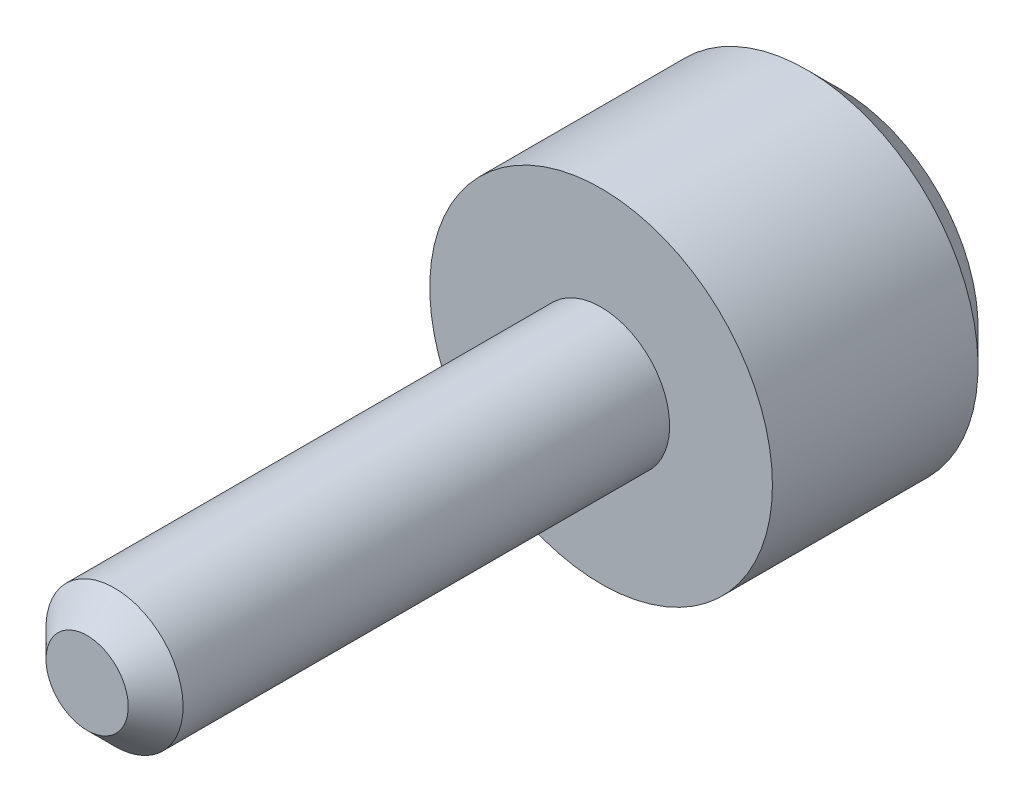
ISO-10303-21;
HEADER;
FILE_DESCRIPTION(('STEP AP214'),'2;1');
FILE_NAME('part.step','',(''),(''),'','','');
FILE_SCHEMA(('AUTOMOTIVE_DESIGN { 1 0 10303 214 1 1 1 1 }'));
ENDSEC;
DATA;
#1=APPLICATION_CONTEXT('core data for automotive mechanical design processes');
#2=APPLICATION_PROTOCOL_DEFINITION('international standard','automotive_design',2000,#1);
#3=PRODUCT_CONTEXT('',#1,'mechanical');
#4=PRODUCT('Part','Part','',(#3));
#5=PRODUCT_RELATED_PRODUCT_CATEGORY('part','',(#4));
#6=PRODUCT_DEFINITION_FORMATION('','',#4);
#7=PRODUCT_DEFINITION_CONTEXT('part definition',#1,'design');
#8=PRODUCT_DEFINITION('design','',#6,#7);
#9=PRODUCT_DEFINITION_SHAPE('','',#8);
#10=(LENGTH_UNIT() NAMED_UNIT(*) SI_UNIT(.MILLI.,.METRE.));
#11=(NAMED_UNIT(*) PLANE_ANGLE_UNIT() SI_UNIT($,.RADIAN.));
#12=(NAMED_UNIT(*) SI_UNIT($,.STERADIAN.) SOLID_ANGLE_UNIT());
#13=UNCERTAINTY_MEASURE_WITH_UNIT(LENGTH_MEASURE(1.E-05),#10,'distance_accuracy_value','');
#14=(GEOMETRIC_REPRESENTATION_CONTEXT(3) GLOBAL_UNCERTAINTY_ASSIGNED_CONTEXT((#13)) GLOBAL_UNIT_ASSIGNED_CONTEXT((#10,
#11,#12)) REPRESENTATION_CONTEXT('',''));
#15=CARTESIAN_POINT('',(0.,0.,0.));
#16=DIRECTION('',(0.,0.,1.));
#17=DIRECTION('',(1.,0.,0.));
#18=AXIS2_PLACEMENT_3D('',#15,#16,#17);
#19=CARTESIAN_POINT('',(0.,0.,0.));
#20=DIRECTION('',(0.,0.,-1.));
#21=DIRECTION('',(-0.500000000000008,0.866025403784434,0.));
#22=AXIS2_PLACEMENT_3D('',#19,#20,#21);
#23=CYLINDRICAL_SURFACE('',#22,5.);
#24=CARTESIAN_POINT('',(0.,0.,1.));
#25=DIRECTION('',(0.,0.,1.));
#26=DIRECTION('',(0.500000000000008,-0.866025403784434,0.));
#27=AXIS2_PLACEMENT_3D('',#24,#25,#26);
#28=CIRCLE('',#27,5.);
#29=CARTESIAN_POINT('',(2.50000000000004,-4.33012701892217,1.00000000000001));
#30=VERTEX_POINT('',#29);
#31=EDGE_CURVE('E109',#30,#30,#28,.T.);
#32=ORIENTED_EDGE('',*,*,#31,.T.);
#33=EDGE_LOOP('',(#32));
#34=FACE_BOUND('',#33,.T.);
#35=CARTESIAN_POINT('',(0.,0.,7.));
#36=DIRECTION('',(0.,0.,-1.));
#37=DIRECTION('',(-0.500000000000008,0.866025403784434,0.));
#38=AXIS2_PLACEMENT_3D('',#35,#36,#37);
#39=CIRCLE('',#38,5.);
#40=CARTESIAN_POINT('',(-2.50000000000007,4.33012701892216,6.99999999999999));
#41=VERTEX_POINT('',#40);
#42=EDGE_CURVE('E74',#41,#41,#39,.T.);
#43=ORIENTED_EDGE('',*,*,#42,.T.);
#44=EDGE_LOOP('',(#43));
#45=FACE_BOUND('',#44,.T.);
#46=ADVANCED_FACE('F14',(#34,#45),#23,.T.);
#47=CARTESIAN_POINT('',(0.,0.,0.));
#48=DIRECTION('',(0.,0.,1.));
#49=DIRECTION('',(0.500000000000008,-0.866025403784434,0.));
#50=AXIS2_PLACEMENT_3D('',#47,#48,#49);
#51=CONICAL_SURFACE('',#50,4.,0.785398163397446);
#52=ORIENTED_EDGE('',*,*,#31,.F.);
#53=EDGE_LOOP('',(#52));
#54=FACE_BOUND('',#53,.T.);
#55=CARTESIAN_POINT('',(0.,0.,0.));
#56=DIRECTION('',(0.,0.,1.));
#57=DIRECTION('',(0.500000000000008,-0.866025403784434,0.));
#58=AXIS2_PLACEMENT_3D('',#55,#56,#57);
#59=CIRCLE('',#58,4.);
#60=CARTESIAN_POINT('',(2.00000000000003,-3.46410161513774,0.));
#61=VERTEX_POINT('',#60);
#62=EDGE_CURVE('E106',#61,#61,#59,.F.);
#63=ORIENTED_EDGE('',*,*,#62,.F.);
#64=EDGE_LOOP('',(#63));
#65=FACE_BOUND('',#64,.T.);
#66=ADVANCED_FACE('F138',(#54,#65),#51,.T.);
#67=CARTESIAN_POINT('',(0.,0.,0.));
#68=DIRECTION('',(0.,0.,1.));
#69=DIRECTION('',(0.500000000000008,-0.866025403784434,0.));
#70=AXIS2_PLACEMENT_3D('',#67,#68,#69);
#71=PLANE('',#70);
#72=CARTESIAN_POINT('',(0.,0.,0.));
#73=DIRECTION('',(0.,0.,-1.));
#74=DIRECTION('',(-1.,0.,0.));
#75=AXIS2_PLACEMENT_3D('',#72,#73,#74);
#76=CIRCLE('',#75,2.1);
#77=CARTESIAN_POINT('',(-2.1,0.,0.));
#78=VERTEX_POINT('',#77);
#79=EDGE_CURVE('E202',#78,#78,#76,.T.);
#80=ORIENTED_EDGE('',*,*,#79,.F.);
#81=EDGE_LOOP('',(#80));
#82=FACE_BOUND('',#81,.T.);
#83=ORIENTED_EDGE('',*,*,#62,.T.);
#84=EDGE_LOOP('',(#83));
#85=FACE_BOUND('',#84,.T.);
#86=ADVANCED_FACE('F128',(#82,#85),#71,.F.);
#87=CARTESIAN_POINT('',(-1.75000000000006,3.03108891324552,7.));
#88=DIRECTION('',(0.,0.,1.));
#89=DIRECTION('',(0.500000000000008,-0.866025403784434,0.));
#90=AXIS2_PLACEMENT_3D('',#87,#88,#89);
#91=PLANE('',#90);
#92=CARTESIAN_POINT('',(0.,0.,7.));
#93=DIRECTION('',(0.,0.,-1.));
#94=DIRECTION('',(-0.500000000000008,0.866025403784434,0.));
#95=AXIS2_PLACEMENT_3D('',#92,#93,#94);
#96=CIRCLE('',#95,2.);
#97=CARTESIAN_POINT('',(-1.00000000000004,1.73205080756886,7.));
#98=VERTEX_POINT('',#97);
#99=EDGE_CURVE('E100',#98,#98,#96,.T.);
#100=ORIENTED_EDGE('',*,*,#99,.T.);
#101=EDGE_LOOP('',(#100));
#102=FACE_BOUND('',#101,.T.);
#103=ORIENTED_EDGE('',*,*,#42,.F.);
#104=EDGE_LOOP('',(#103));
#105=FACE_BOUND('',#104,.T.);
#106=ADVANCED_FACE('F123',(#102,#105),#91,.T.);
#107=CARTESIAN_POINT('',(0.,0.,-1.));
#108=DIRECTION('',(0.,0.,-1.));
#109=DIRECTION('',(-0.500000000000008,0.866025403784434,0.));
#110=AXIS2_PLACEMENT_3D('',#107,#108,#109);
#111=CYLINDRICAL_SURFACE('',#110,2.);
#112=CARTESIAN_POINT('',(0.,0.,21.2));
#113=DIRECTION('',(0.,0.,1.));
#114=DIRECTION('',(0.866025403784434,0.500000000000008,0.));
#115=AXIS2_PLACEMENT_3D('',#112,#113,#114);
#116=CIRCLE('',#115,2.);
#117=CARTESIAN_POINT('',(1.73205080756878,0.999999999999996,21.2));
#118=VERTEX_POINT('',#117);
#119=EDGE_CURVE('E22',#118,#118,#116,.F.);
#120=ORIENTED_EDGE('',*,*,#119,.T.);
#121=EDGE_LOOP('',(#120));
#122=FACE_BOUND('',#121,.T.);
#123=ORIENTED_EDGE('',*,*,#99,.F.);
#124=EDGE_LOOP('',(#123));
#125=FACE_BOUND('',#124,.T.);
#126=ADVANCED_FACE('F116',(#122,#125),#111,.T.);
#127=CARTESIAN_POINT('',(0.,0.,22.));
#128=DIRECTION('',(0.,0.,1.));
#129=DIRECTION('',(0.500000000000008,-0.866025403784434,0.));
#130=AXIS2_PLACEMENT_3D('',#127,#128,#129);
#131=PLANE('',#130);
#132=CARTESIAN_POINT('',(0.,0.,22.));
#133=DIRECTION('',(0.,0.,1.));
#134=DIRECTION('',(0.866025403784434,0.500000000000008,0.));
#135=AXIS2_PLACEMENT_3D('',#132,#133,#134);
#136=CIRCLE('',#135,1.2);
#137=CARTESIAN_POINT('',(1.03923048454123,0.599999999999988,22.));
#138=VERTEX_POINT('',#137);
#139=EDGE_CURVE('E103',#138,#138,#136,.T.);
#140=ORIENTED_EDGE('',*,*,#139,.T.);
#141=EDGE_LOOP('',(#140));
#142=FACE_BOUND('',#141,.T.);
#143=ADVANCED_FACE('F122',(#142),#131,.T.);
#144=CARTESIAN_POINT('',(0.,0.,22.));
#145=DIRECTION('',(0.,0.,-1.));
#146=DIRECTION('',(-0.866025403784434,-0.500000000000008,0.));
#147=AXIS2_PLACEMENT_3D('',#144,#145,#146);
#148=CONICAL_SURFACE('',#147,1.2,0.785398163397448);
#149=ORIENTED_EDGE('',*,*,#119,.F.);
#150=EDGE_LOOP('',(#149));
#151=FACE_BOUND('',#150,.T.);
#152=ORIENTED_EDGE('',*,*,#139,.F.);
#153=EDGE_LOOP('',(#152));
#154=FACE_BOUND('',#153,.T.);
#155=ADVANCED_FACE('F16',(#151,#154),#148,.T.);
#156=CARTESIAN_POINT('',(0.,0.,3.));
#157=DIRECTION('',(0.,0.,-1.));
#158=DIRECTION('',(-1.,0.,0.));
#159=AXIS2_PLACEMENT_3D('',#156,#157,#158);
#160=CYLINDRICAL_SURFACE('',#159,2.1);
#161=CARTESIAN_POINT('',(0.,0.,3.));
#162=DIRECTION('',(0.,0.,-1.));
#163=DIRECTION('',(-1.,0.,0.));
#164=AXIS2_PLACEMENT_3D('',#161,#162,#163);
#165=CIRCLE('',#164,2.1);
#166=CARTESIAN_POINT('',(-2.10000000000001,0.,2.99999999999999));
#167=VERTEX_POINT('',#166);
#168=EDGE_CURVE('E201',#167,#167,#165,.T.);
#169=ORIENTED_EDGE('',*,*,#168,.F.);
#170=EDGE_LOOP('',(#169));
#171=FACE_BOUND('',#170,.T.);
#172=ORIENTED_EDGE('',*,*,#79,.T.);
#173=EDGE_LOOP('',(#172));
#174=FACE_BOUND('',#173,.T.);
#175=ADVANCED_FACE('F121',(#171,#174),#160,.F.);
#176=CARTESIAN_POINT('',(0.,0.,3.));
#177=DIRECTION('',(0.,0.,-1.));
#178=DIRECTION('',(-1.,0.,0.));
#179=AXIS2_PLACEMENT_3D('',#176,#177,#178);
#180=PLANE('',#179);
#181=DIRECTION('',(-0.866025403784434,-0.500000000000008,0.));
#182=VECTOR('',#181,1.);
#183=CARTESIAN_POINT('',(-1.5,0.866025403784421,3.));
#184=LINE('',#183,#182);
#185=CARTESIAN_POINT('',(0.,1.73205080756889,3.));
#186=VERTEX_POINT('',#185);
#187=CARTESIAN_POINT('',(-1.5,0.866025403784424,3.));
#188=VERTEX_POINT('',#187);
#189=EDGE_CURVE('E75',#186,#188,#184,.T.);
#190=ORIENTED_EDGE('',*,*,#189,.T.);
#191=DIRECTION('',(0.,-1.,0.));
#192=VECTOR('',#191,1.);
#193=CARTESIAN_POINT('',(-1.5,-0.866025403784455,3.));
#194=LINE('',#193,#192);
#195=CARTESIAN_POINT('',(-1.5,-0.866025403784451,3.));
#196=VERTEX_POINT('',#195);
#197=EDGE_CURVE('E195',#188,#196,#194,.T.);
#198=ORIENTED_EDGE('',*,*,#197,.T.);
#199=DIRECTION('',(-0.866025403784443,0.499999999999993,0.));
#200=VECTOR('',#199,1.);
#201=CARTESIAN_POINT('',(-1.5,-0.866025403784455,3.));
#202=LINE('',#201,#200);
#203=CARTESIAN_POINT('',(0.,-1.73205080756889,3.));
#204=VERTEX_POINT('',#203);
#205=EDGE_CURVE('E197',#204,#196,#202,.T.);
#206=ORIENTED_EDGE('',*,*,#205,.F.);
#207=DIRECTION('',(0.866025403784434,0.500000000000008,0.));
#208=VECTOR('',#207,1.);
#209=CARTESIAN_POINT('',(1.5,-0.866025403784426,3.));
#210=LINE('',#209,#208);
#211=CARTESIAN_POINT('',(1.5,-0.866025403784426,3.));
#212=VERTEX_POINT('',#211);
#213=EDGE_CURVE('E28',#204,#212,#210,.T.);
#214=ORIENTED_EDGE('',*,*,#213,.T.);
#215=DIRECTION('',(0.,1.,0.));
#216=VECTOR('',#215,1.);
#217=CARTESIAN_POINT('',(1.49999999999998,0.866025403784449,3.));
#218=LINE('',#217,#216);
#219=CARTESIAN_POINT('',(1.49999999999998,0.866025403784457,3.));
#220=VERTEX_POINT('',#219);
#221=EDGE_CURVE('E9',#212,#220,#218,.T.);
#222=ORIENTED_EDGE('',*,*,#221,.T.);
#223=DIRECTION('',(0.866025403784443,-0.499999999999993,0.));
#224=VECTOR('',#223,1.);
#225=CARTESIAN_POINT('',(1.49999999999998,0.866025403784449,3.));
#226=LINE('',#225,#224);
#227=EDGE_CURVE('E67',#186,#220,#226,.T.);
#228=ORIENTED_EDGE('',*,*,#227,.F.);
#229=EDGE_LOOP('',(#190,#198,#206,#214,#222,#228));
#230=FACE_BOUND('',#229,.T.);
#231=ORIENTED_EDGE('',*,*,#168,.T.);
#232=EDGE_LOOP('',(#231));
#233=FACE_BOUND('',#232,.T.);
#234=ADVANCED_FACE('F65',(#230,#233),#180,.T.);
#235=CARTESIAN_POINT('',(0.,1.73205080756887,5.));
#236=DIRECTION('',(0.,0.,-1.));
#237=DIRECTION('',(-0.500000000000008,0.866025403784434,0.));
#238=AXIS2_PLACEMENT_3D('',#235,#236,#237);
#239=PLANE('',#238);
#240=DIRECTION('',(-0.866025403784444,0.499999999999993,0.));
#241=VECTOR('',#240,1.);
#242=CARTESIAN_POINT('',(1.49999999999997,0.866025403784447,5.));
#243=LINE('',#242,#241);
#244=CARTESIAN_POINT('',(1.49999999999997,0.866025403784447,5.));
#245=VERTEX_POINT('',#244);
#246=CARTESIAN_POINT('',(0.,1.73205080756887,5.));
#247=VERTEX_POINT('',#246);
#248=EDGE_CURVE('E88',#245,#247,#243,.T.);
#249=ORIENTED_EDGE('',*,*,#248,.F.);
#250=DIRECTION('',(0.,-1.,0.));
#251=VECTOR('',#250,1.);
#252=CARTESIAN_POINT('',(1.49999999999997,0.866025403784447,5.));
#253=LINE('',#252,#251);
#254=CARTESIAN_POINT('',(1.5,-0.866025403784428,5.));
#255=VERTEX_POINT('',#254);
#256=EDGE_CURVE('E80',#245,#255,#253,.T.);
#257=ORIENTED_EDGE('',*,*,#256,.T.);
#258=DIRECTION('',(-0.866025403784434,-0.500000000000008,0.));
#259=VECTOR('',#258,1.);
#260=CARTESIAN_POINT('',(1.5,-0.866025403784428,5.));
#261=LINE('',#260,#259);
#262=CARTESIAN_POINT('',(0.,-1.73205080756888,5.));
#263=VERTEX_POINT('',#262);
#264=EDGE_CURVE('E85',#255,#263,#261,.T.);
#265=ORIENTED_EDGE('',*,*,#264,.T.);
#266=DIRECTION('',(0.866025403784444,-0.499999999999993,0.));
#267=VECTOR('',#266,1.);
#268=CARTESIAN_POINT('',(-1.5,-0.866025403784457,5.));
#269=LINE('',#268,#267);
#270=CARTESIAN_POINT('',(-1.5,-0.866025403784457,5.));
#271=VERTEX_POINT('',#270);
#272=EDGE_CURVE('E188',#271,#263,#269,.T.);
#273=ORIENTED_EDGE('',*,*,#272,.F.);
#274=DIRECTION('',(0.,1.,0.));
#275=VECTOR('',#274,1.);
#276=CARTESIAN_POINT('',(-1.5,-0.866025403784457,5.));
#277=LINE('',#276,#275);
#278=CARTESIAN_POINT('',(-1.50000000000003,0.866025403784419,5.));
#279=VERTEX_POINT('',#278);
#280=EDGE_CURVE('E187',#271,#279,#277,.T.);
#281=ORIENTED_EDGE('',*,*,#280,.T.);
#282=DIRECTION('',(0.866025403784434,0.500000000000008,0.));
#283=VECTOR('',#282,1.);
#284=CARTESIAN_POINT('',(-1.50000000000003,0.866025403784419,5.));
#285=LINE('',#284,#283);
#286=EDGE_CURVE('E186',#279,#247,#285,.T.);
#287=ORIENTED_EDGE('',*,*,#286,.T.);
#288=EDGE_LOOP('',(#249,#257,#265,#273,#281,#287));
#289=FACE_BOUND('',#288,.T.);
#290=ADVANCED_FACE('F173',(#289),#239,.T.);
#291=CARTESIAN_POINT('',(1.49999999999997,0.866025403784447,5.));
#292=DIRECTION('',(1.,0.,0.));
#293=DIRECTION('',(0.,-1.,0.));
#294=AXIS2_PLACEMENT_3D('',#291,#292,#293);
#295=PLANE('',#294);
#296=ORIENTED_EDGE('',*,*,#221,.F.);
#297=DIRECTION('',(0.,0.,-1.));
#298=VECTOR('',#297,1.);
#299=CARTESIAN_POINT('',(1.5,-0.866025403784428,5.));
#300=LINE('',#299,#298);
#301=EDGE_CURVE('E81',#255,#212,#300,.T.);
#302=ORIENTED_EDGE('',*,*,#301,.F.);
#303=ORIENTED_EDGE('',*,*,#256,.F.);
#304=DIRECTION('',(0.,0.,-1.));
#305=VECTOR('',#304,1.);
#306=CARTESIAN_POINT('',(1.49999999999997,0.866025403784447,5.));
#307=LINE('',#306,#305);
#308=EDGE_CURVE('E36',#245,#220,#307,.T.);
#309=ORIENTED_EDGE('',*,*,#308,.T.);
#310=EDGE_LOOP('',(#296,#302,#303,#309));
#311=FACE_BOUND('',#310,.T.);
#312=ADVANCED_FACE('F78',(#311),#295,.F.);
#313=CARTESIAN_POINT('',(1.5,-0.866025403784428,5.));
#314=DIRECTION('',(0.500000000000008,-0.866025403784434,0.));
#315=DIRECTION('',(-0.866025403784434,-0.500000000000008,0.));
#316=AXIS2_PLACEMENT_3D('',#313,#314,#315);
#317=PLANE('',#316);
#318=ORIENTED_EDGE('',*,*,#213,.F.);
#319=DIRECTION('',(0.,0.,-1.));
#320=VECTOR('',#319,1.);
#321=CARTESIAN_POINT('',(0.,-1.73205080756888,5.));
#322=LINE('',#321,#320);
#323=EDGE_CURVE('E83',#263,#204,#322,.T.);
#324=ORIENTED_EDGE('',*,*,#323,.F.);
#325=ORIENTED_EDGE('',*,*,#264,.F.);
#326=ORIENTED_EDGE('',*,*,#301,.T.);
#327=EDGE_LOOP('',(#318,#324,#325,#326));
#328=FACE_BOUND('',#327,.T.);
#329=ADVANCED_FACE('F166',(#328),#317,.F.);
#330=CARTESIAN_POINT('',(-1.5,-0.866025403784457,5.));
#331=DIRECTION('',(0.499999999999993,0.866025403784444,0.));
#332=DIRECTION('',(0.866025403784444,-0.499999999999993,0.));
#333=AXIS2_PLACEMENT_3D('',#330,#331,#332);
#334=PLANE('',#333);
#335=ORIENTED_EDGE('',*,*,#323,.T.);
#336=ORIENTED_EDGE('',*,*,#205,.T.);
#337=DIRECTION('',(0.,0.,-1.));
#338=VECTOR('',#337,1.);
#339=CARTESIAN_POINT('',(-1.5,-0.866025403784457,5.));
#340=LINE('',#339,#338);
#341=EDGE_CURVE('E93',#271,#196,#340,.T.);
#342=ORIENTED_EDGE('',*,*,#341,.F.);
#343=ORIENTED_EDGE('',*,*,#272,.T.);
#344=EDGE_LOOP('',(#335,#336,#342,#343));
#345=FACE_BOUND('',#344,.T.);
#346=ADVANCED_FACE('F162',(#345),#334,.T.);
#347=CARTESIAN_POINT('',(-1.5,-0.866025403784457,5.));
#348=DIRECTION('',(-1.,0.,0.));
#349=DIRECTION('',(0.,1.,0.));
#350=AXIS2_PLACEMENT_3D('',#347,#348,#349);
#351=PLANE('',#350);
#352=ORIENTED_EDGE('',*,*,#197,.F.);
#353=DIRECTION('',(0.,0.,-1.));
#354=VECTOR('',#353,1.);
#355=CARTESIAN_POINT('',(-1.50000000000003,0.866025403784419,5.));
#356=LINE('',#355,#354);
#357=EDGE_CURVE('E96',#279,#188,#356,.T.);
#358=ORIENTED_EDGE('',*,*,#357,.F.);
#359=ORIENTED_EDGE('',*,*,#280,.F.);
#360=ORIENTED_EDGE('',*,*,#341,.T.);
#361=EDGE_LOOP('',(#352,#358,#359,#360));
#362=FACE_BOUND('',#361,.T.);
#363=ADVANCED_FACE('F158',(#362),#351,.F.);
#364=CARTESIAN_POINT('',(-1.50000000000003,0.866025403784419,5.));
#365=DIRECTION('',(-0.500000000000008,0.866025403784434,0.));
#366=DIRECTION('',(0.866025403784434,0.500000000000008,0.));
#367=AXIS2_PLACEMENT_3D('',#364,#365,#366);
#368=PLANE('',#367);
#369=ORIENTED_EDGE('',*,*,#189,.F.);
#370=DIRECTION('',(0.,0.,-1.));
#371=VECTOR('',#370,1.);
#372=CARTESIAN_POINT('',(0.,1.73205080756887,5.));
#373=LINE('',#372,#371);
#374=EDGE_CURVE('E73',#247,#186,#373,.T.);
#375=ORIENTED_EDGE('',*,*,#374,.F.);
#376=ORIENTED_EDGE('',*,*,#286,.F.);
#377=ORIENTED_EDGE('',*,*,#357,.T.);
#378=EDGE_LOOP('',(#369,#375,#376,#377));
#379=FACE_BOUND('',#378,.T.);
#380=ADVANCED_FACE('F155',(#379),#368,.F.);
#381=CARTESIAN_POINT('',(1.49999999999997,0.866025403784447,5.));
#382=DIRECTION('',(-0.499999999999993,-0.866025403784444,0.));
#383=DIRECTION('',(-0.866025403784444,0.499999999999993,0.));
#384=AXIS2_PLACEMENT_3D('',#381,#382,#383);
#385=PLANE('',#384);
#386=ORIENTED_EDGE('',*,*,#374,.T.);
#387=ORIENTED_EDGE('',*,*,#227,.T.);
#388=ORIENTED_EDGE('',*,*,#308,.F.);
#389=ORIENTED_EDGE('',*,*,#248,.T.);
#390=EDGE_LOOP('',(#386,#387,#388,#389));
#391=FACE_BOUND('',#390,.T.);
#392=ADVANCED_FACE('F72',(#391),#385,.T.);
#393=CLOSED_SHELL('',(#46,#66,#86,#106,#126,#143,#155,#175,#234,#290,#312,#329,#346,#363,#380,#392));
#394=MANIFOLD_SOLID_BREP('B1',#393);
#395=ADVANCED_BREP_SHAPE_REPRESENTATION('',(#18,#394),#14);
#396=SHAPE_DEFINITION_REPRESENTATION(#9,#395);
ENDSEC;
END-ISO-10303-21;
